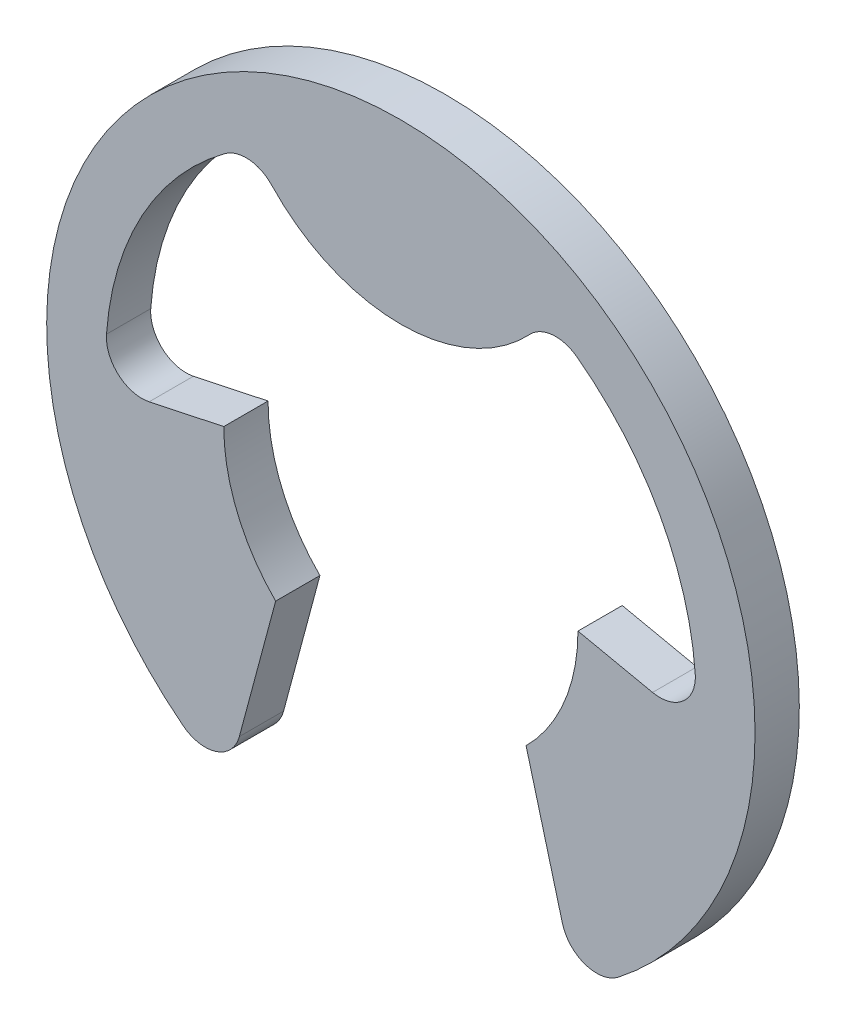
ISO-10303-21;
HEADER;
FILE_DESCRIPTION(('STEP AP214'),'2;1');
FILE_NAME('part.step','',(''),(''),'','','');
FILE_SCHEMA(('AUTOMOTIVE_DESIGN { 1 0 10303 214 1 1 1 1 }'));
ENDSEC;
DATA;
#1=APPLICATION_CONTEXT('core data for automotive mechanical design processes');
#2=APPLICATION_PROTOCOL_DEFINITION('international standard','automotive_design',2000,#1);
#3=PRODUCT_CONTEXT('',#1,'mechanical');
#4=PRODUCT('Part','Part','',(#3));
#5=PRODUCT_RELATED_PRODUCT_CATEGORY('part','',(#4));
#6=PRODUCT_DEFINITION_FORMATION('','',#4);
#7=PRODUCT_DEFINITION_CONTEXT('part definition',#1,'design');
#8=PRODUCT_DEFINITION('design','',#6,#7);
#9=PRODUCT_DEFINITION_SHAPE('','',#8);
#10=(LENGTH_UNIT() NAMED_UNIT(*) SI_UNIT(.MILLI.,.METRE.));
#11=(NAMED_UNIT(*) PLANE_ANGLE_UNIT() SI_UNIT($,.RADIAN.));
#12=(NAMED_UNIT(*) SI_UNIT($,.STERADIAN.) SOLID_ANGLE_UNIT());
#13=UNCERTAINTY_MEASURE_WITH_UNIT(LENGTH_MEASURE(1.E-05),#10,'distance_accuracy_value','');
#14=(GEOMETRIC_REPRESENTATION_CONTEXT(3) GLOBAL_UNCERTAINTY_ASSIGNED_CONTEXT((#13)) GLOBAL_UNIT_ASSIGNED_CONTEXT((#10,
#11,#12)) REPRESENTATION_CONTEXT('',''));
#15=CARTESIAN_POINT('',(0.,0.,0.));
#16=DIRECTION('',(0.,0.,1.));
#17=DIRECTION('',(1.,0.,0.));
#18=AXIS2_PLACEMENT_3D('',#15,#16,#17);
#19=CARTESIAN_POINT('',(0.,8.,-0.5));
#20=DIRECTION('',(0.,0.,1.));
#21=DIRECTION('',(1.,0.,0.));
#22=AXIS2_PLACEMENT_3D('',#19,#20,#21);
#23=PLANE('',#22);
#24=CARTESIAN_POINT('',(0.,0.,-0.5));
#25=DIRECTION('',(0.,0.,-1.));
#26=DIRECTION('',(-1.,0.,0.));
#27=AXIS2_PLACEMENT_3D('',#24,#25,#26);
#28=CIRCLE('',#27,6.666666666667);
#29=CARTESIAN_POINT('',(-3.97292130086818,5.35353535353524,-0.5));
#30=VERTEX_POINT('',#29);
#31=CARTESIAN_POINT('',(-6.64919627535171,0.482320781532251,-0.5));
#32=VERTEX_POINT('',#31);
#33=EDGE_CURVE('E204',#30,#32,#28,.F.);
#34=ORIENTED_EDGE('',*,*,#33,.T.);
#35=CARTESIAN_POINT('',(-5.851298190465,0.4243668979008,-0.5));
#36=DIRECTION('',(0.,0.,1.));
#37=DIRECTION('',(1.,0.,0.));
#38=AXIS2_PLACEMENT_3D('',#35,#36,#37);
#39=CIRCLE('',#38,0.8);
#40=CARTESIAN_POINT('',(-5.68496883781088,-0.358151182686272,-0.5));
#41=VERTEX_POINT('',#40);
#42=EDGE_CURVE('E206',#32,#41,#39,.T.);
#43=ORIENTED_EDGE('',*,*,#42,.T.);
#44=DIRECTION('',(0.978147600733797,0.207911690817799,0.));
#45=VECTOR('',#44,1.);
#46=CARTESIAN_POINT('',(-5.684968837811,-0.3581511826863,-0.5));
#47=LINE('',#46,#45);
#48=CARTESIAN_POINT('',(-4.,0.,-0.5));
#49=VERTEX_POINT('',#48);
#50=EDGE_CURVE('E153',#41,#49,#47,.T.);
#51=ORIENTED_EDGE('',*,*,#50,.T.);
#52=CARTESIAN_POINT('',(0.,0.,-0.5));
#53=DIRECTION('',(0.,0.,-1.));
#54=DIRECTION('',(-1.,0.,0.));
#55=AXIS2_PLACEMENT_3D('',#52,#53,#54);
#56=CIRCLE('',#55,4.);
#57=CARTESIAN_POINT('',(-2.82842712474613,-2.82842712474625,-0.5));
#58=VERTEX_POINT('',#57);
#59=EDGE_CURVE('E209',#49,#58,#56,.F.);
#60=ORIENTED_EDGE('',*,*,#59,.T.);
#61=DIRECTION('',(-0.258819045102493,-0.965925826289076,0.));
#62=VECTOR('',#61,1.);
#63=CARTESIAN_POINT('',(-2.828427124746,-2.828427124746,-0.5));
#64=LINE('',#63,#62);
#65=CARTESIAN_POINT('',(-3.64866297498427,-5.88958899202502,-0.5));
#66=VERTEX_POINT('',#65);
#67=EDGE_CURVE('E157',#58,#66,#64,.T.);
#68=ORIENTED_EDGE('',*,*,#67,.T.);
#69=CARTESIAN_POINT('',(-4.421403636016,-5.682533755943,-0.5));
#70=DIRECTION('',(0.,0.,-1.));
#71=DIRECTION('',(-1.,0.,0.));
#72=AXIS2_PLACEMENT_3D('',#69,#70,#71);
#73=CIRCLE('',#72,0.8);
#74=CARTESIAN_POINT('',(-4.91267070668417,-6.31392639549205,-0.5));
#75=VERTEX_POINT('',#74);
#76=EDGE_CURVE('E160',#75,#66,#73,.F.);
#77=ORIENTED_EDGE('',*,*,#76,.F.);
#78=CARTESIAN_POINT('',(0.,0.,-0.5));
#79=DIRECTION('',(0.,0.,-1.));
#80=DIRECTION('',(-1.,0.,0.));
#81=AXIS2_PLACEMENT_3D('',#78,#79,#80);
#82=CIRCLE('',#81,8.);
#83=CARTESIAN_POINT('',(4.91267070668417,-6.31392639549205,-0.5));
#84=VERTEX_POINT('',#83);
#85=EDGE_CURVE('E214',#84,#75,#82,.F.);
#86=ORIENTED_EDGE('',*,*,#85,.F.);
#87=CARTESIAN_POINT('',(4.421403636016,-5.682533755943,-0.5));
#88=DIRECTION('',(0.,0.,-1.));
#89=DIRECTION('',(-1.,0.,0.));
#90=AXIS2_PLACEMENT_3D('',#87,#88,#89);
#91=CIRCLE('',#90,0.8);
#92=CARTESIAN_POINT('',(3.64866297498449,-5.88958899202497,-0.5));
#93=VERTEX_POINT('',#92);
#94=EDGE_CURVE('E217',#93,#84,#91,.F.);
#95=ORIENTED_EDGE('',*,*,#94,.F.);
#96=DIRECTION('',(-0.258819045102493,0.965925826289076,0.));
#97=VECTOR('',#96,1.);
#98=CARTESIAN_POINT('',(2.828427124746,-2.828427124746,-0.5));
#99=LINE('',#98,#97);
#100=CARTESIAN_POINT('',(2.82842712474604,-2.82842712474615,-0.5));
#101=VERTEX_POINT('',#100);
#102=EDGE_CURVE('E161',#93,#101,#99,.T.);
#103=ORIENTED_EDGE('',*,*,#102,.T.);
#104=CARTESIAN_POINT('',(0.,0.,-0.5));
#105=DIRECTION('',(0.,0.,-1.));
#106=DIRECTION('',(-1.,0.,0.));
#107=AXIS2_PLACEMENT_3D('',#104,#105,#106);
#108=CIRCLE('',#107,4.);
#109=CARTESIAN_POINT('',(4.,0.,-0.5));
#110=VERTEX_POINT('',#109);
#111=EDGE_CURVE('E221',#101,#110,#108,.F.);
#112=ORIENTED_EDGE('',*,*,#111,.T.);
#113=DIRECTION('',(0.978147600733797,-0.207911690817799,0.));
#114=VECTOR('',#113,1.);
#115=CARTESIAN_POINT('',(5.684968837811,-0.3581511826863,-0.5));
#116=LINE('',#115,#114);
#117=CARTESIAN_POINT('',(5.68496883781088,-0.358151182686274,-0.5));
#118=VERTEX_POINT('',#117);
#119=EDGE_CURVE('E165',#110,#118,#116,.T.);
#120=ORIENTED_EDGE('',*,*,#119,.T.);
#121=CARTESIAN_POINT('',(5.851298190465,0.4243668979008,-0.5));
#122=DIRECTION('',(0.,0.,-1.));
#123=DIRECTION('',(-1.,0.,0.));
#124=AXIS2_PLACEMENT_3D('',#121,#122,#123);
#125=CIRCLE('',#124,0.8);
#126=CARTESIAN_POINT('',(6.64920248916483,0.482235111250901,-0.5));
#127=VERTEX_POINT('',#126);
#128=EDGE_CURVE('E133',#118,#127,#125,.F.);
#129=ORIENTED_EDGE('',*,*,#128,.T.);
#130=CARTESIAN_POINT('',(0.,0.,-0.5));
#131=DIRECTION('',(0.,0.,-1.));
#132=DIRECTION('',(-1.,0.,0.));
#133=AXIS2_PLACEMENT_3D('',#130,#131,#132);
#134=CIRCLE('',#133,6.666666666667);
#135=CARTESIAN_POINT('',(3.97292130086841,5.35353535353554,-0.5));
#136=VERTEX_POINT('',#135);
#137=EDGE_CURVE('E128',#127,#136,#134,.F.);
#138=ORIENTED_EDGE('',*,*,#137,.T.);
#139=CARTESIAN_POINT('',(3.496170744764,4.711111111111,-0.5));
#140=DIRECTION('',(0.,0.,-1.));
#141=DIRECTION('',(-1.,0.,0.));
#142=AXIS2_PLACEMENT_3D('',#139,#140,#141);
#143=CIRCLE('',#142,0.8);
#144=CARTESIAN_POINT('',(2.91347562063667,5.25925925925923,-0.5));
#145=VERTEX_POINT('',#144);
#146=EDGE_CURVE('E21',#136,#145,#143,.F.);
#147=ORIENTED_EDGE('',*,*,#146,.T.);
#148=CARTESIAN_POINT('',(0.,8.,-0.5));
#149=DIRECTION('',(0.,0.,-1.));
#150=DIRECTION('',(-1.,0.,0.));
#151=AXIS2_PLACEMENT_3D('',#148,#149,#150);
#152=CIRCLE('',#151,4.);
#153=CARTESIAN_POINT('',(-2.91347562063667,5.25925925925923,-0.5));
#154=VERTEX_POINT('',#153);
#155=EDGE_CURVE('E198',#154,#145,#152,.F.);
#156=ORIENTED_EDGE('',*,*,#155,.F.);
#157=CARTESIAN_POINT('',(-3.496170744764,4.711111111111,-0.5));
#158=DIRECTION('',(0.,0.,-1.));
#159=DIRECTION('',(-1.,0.,0.));
#160=AXIS2_PLACEMENT_3D('',#157,#158,#159);
#161=CIRCLE('',#160,0.8);
#162=EDGE_CURVE('E200',#154,#30,#161,.F.);
#163=ORIENTED_EDGE('',*,*,#162,.T.);
#164=EDGE_LOOP('',(#34,#43,#51,#60,#68,#77,#86,#95,#103,#112,#120,#129,#138,#147,#156,#163));
#165=FACE_BOUND('',#164,.T.);
#166=ADVANCED_FACE('F17',(#165),#23,.F.);
#167=CARTESIAN_POINT('',(3.496170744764,4.711111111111,0.5));
#168=DIRECTION('',(0.,0.,-1.));
#169=DIRECTION('',(-1.,0.,0.));
#170=AXIS2_PLACEMENT_3D('',#167,#168,#169);
#171=CYLINDRICAL_SURFACE('',#170,0.8);
#172=CARTESIAN_POINT('',(3.496170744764,4.711111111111,0.5));
#173=DIRECTION('',(0.,0.,-1.));
#174=DIRECTION('',(-1.,0.,0.));
#175=AXIS2_PLACEMENT_3D('',#172,#173,#174);
#176=CIRCLE('',#175,0.8);
#177=CARTESIAN_POINT('',(2.91347562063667,5.25925925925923,0.5));
#178=VERTEX_POINT('',#177);
#179=CARTESIAN_POINT('',(3.97292130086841,5.35353535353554,0.5));
#180=VERTEX_POINT('',#179);
#181=EDGE_CURVE('E196',#178,#180,#176,.T.);
#182=ORIENTED_EDGE('',*,*,#181,.F.);
#183=DIRECTION('',(0.,0.,-1.));
#184=VECTOR('',#183,1.);
#185=CARTESIAN_POINT('',(2.91347562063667,5.25925925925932,0.5));
#186=LINE('',#185,#184);
#187=EDGE_CURVE('E142',#145,#178,#186,.F.);
#188=ORIENTED_EDGE('',*,*,#187,.F.);
#189=ORIENTED_EDGE('',*,*,#146,.F.);
#190=DIRECTION('',(0.,0.,-1.));
#191=VECTOR('',#190,1.);
#192=CARTESIAN_POINT('',(3.97292130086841,5.35353535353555,0.5));
#193=LINE('',#192,#191);
#194=EDGE_CURVE('E137',#136,#180,#193,.F.);
#195=ORIENTED_EDGE('',*,*,#194,.T.);
#196=EDGE_LOOP('',(#182,#188,#189,#195));
#197=FACE_BOUND('',#196,.T.);
#198=ADVANCED_FACE('F139',(#197),#171,.F.);
#199=CARTESIAN_POINT('',(0.,0.,0.5));
#200=DIRECTION('',(0.,0.,-1.));
#201=DIRECTION('',(-1.,0.,0.));
#202=AXIS2_PLACEMENT_3D('',#199,#200,#201);
#203=CYLINDRICAL_SURFACE('',#202,6.666666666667);
#204=CARTESIAN_POINT('',(0.,0.,0.5));
#205=DIRECTION('',(0.,0.,-1.));
#206=DIRECTION('',(-1.,0.,0.));
#207=AXIS2_PLACEMENT_3D('',#204,#205,#206);
#208=CIRCLE('',#207,6.666666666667);
#209=CARTESIAN_POINT('',(6.64920248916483,0.482235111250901,0.5));
#210=VERTEX_POINT('',#209);
#211=EDGE_CURVE('E146',#180,#210,#208,.T.);
#212=ORIENTED_EDGE('',*,*,#211,.F.);
#213=ORIENTED_EDGE('',*,*,#194,.F.);
#214=ORIENTED_EDGE('',*,*,#137,.F.);
#215=DIRECTION('',(0.,0.,-1.));
#216=VECTOR('',#215,1.);
#217=CARTESIAN_POINT('',(6.64920248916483,0.482235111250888,0.5));
#218=LINE('',#217,#216);
#219=EDGE_CURVE('E148',#127,#210,#218,.F.);
#220=ORIENTED_EDGE('',*,*,#219,.T.);
#221=EDGE_LOOP('',(#212,#213,#214,#220));
#222=FACE_BOUND('',#221,.T.);
#223=ADVANCED_FACE('F144',(#222),#203,.F.);
#224=CARTESIAN_POINT('',(5.851298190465,0.4243668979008,0.5));
#225=DIRECTION('',(0.,0.,-1.));
#226=DIRECTION('',(-1.,0.,0.));
#227=AXIS2_PLACEMENT_3D('',#224,#225,#226);
#228=CYLINDRICAL_SURFACE('',#227,0.8);
#229=DIRECTION('',(0.,0.,1.));
#230=VECTOR('',#229,1.);
#231=CARTESIAN_POINT('',(5.684968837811,-0.3581511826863,0.5));
#232=LINE('',#231,#230);
#233=CARTESIAN_POINT('',(5.68496883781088,-0.358151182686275,0.5));
#234=VERTEX_POINT('',#233);
#235=EDGE_CURVE('E166',#118,#234,#232,.T.);
#236=ORIENTED_EDGE('',*,*,#235,.T.);
#237=CARTESIAN_POINT('',(5.851298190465,0.4243668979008,0.5));
#238=DIRECTION('',(0.,0.,1.));
#239=DIRECTION('',(1.,0.,0.));
#240=AXIS2_PLACEMENT_3D('',#237,#238,#239);
#241=CIRCLE('',#240,0.8);
#242=EDGE_CURVE('E193',#210,#234,#241,.F.);
#243=ORIENTED_EDGE('',*,*,#242,.F.);
#244=ORIENTED_EDGE('',*,*,#219,.F.);
#245=ORIENTED_EDGE('',*,*,#128,.F.);
#246=EDGE_LOOP('',(#236,#243,#244,#245));
#247=FACE_BOUND('',#246,.T.);
#248=ADVANCED_FACE('F321',(#247),#228,.F.);
#249=CARTESIAN_POINT('',(5.684968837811,-0.3581511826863,0.5));
#250=DIRECTION('',(-0.207911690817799,-0.978147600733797,0.));
#251=DIRECTION('',(0.978147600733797,-0.207911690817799,0.));
#252=AXIS2_PLACEMENT_3D('',#249,#250,#251);
#253=PLANE('',#252);
#254=DIRECTION('',(-0.978147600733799,0.207911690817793,0.));
#255=VECTOR('',#254,1.);
#256=CARTESIAN_POINT('',(5.684968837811,-0.358151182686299,0.5));
#257=LINE('',#256,#255);
#258=CARTESIAN_POINT('',(4.,0.,0.5));
#259=VERTEX_POINT('',#258);
#260=EDGE_CURVE('E192',#234,#259,#257,.T.);
#261=ORIENTED_EDGE('',*,*,#260,.F.);
#262=ORIENTED_EDGE('',*,*,#235,.F.);
#263=ORIENTED_EDGE('',*,*,#119,.F.);
#264=DIRECTION('',(0.,0.,-1.));
#265=VECTOR('',#264,1.);
#266=CARTESIAN_POINT('',(4.,0.,0.5));
#267=LINE('',#266,#265);
#268=EDGE_CURVE('E164',#110,#259,#267,.F.);
#269=ORIENTED_EDGE('',*,*,#268,.T.);
#270=EDGE_LOOP('',(#261,#262,#263,#269));
#271=FACE_BOUND('',#270,.T.);
#272=ADVANCED_FACE('F317',(#271),#253,.F.);
#273=CARTESIAN_POINT('',(0.,0.,0.5));
#274=DIRECTION('',(0.,0.,-1.));
#275=DIRECTION('',(-1.,0.,0.));
#276=AXIS2_PLACEMENT_3D('',#273,#274,#275);
#277=CYLINDRICAL_SURFACE('',#276,4.);
#278=CARTESIAN_POINT('',(0.,0.,0.5));
#279=DIRECTION('',(0.,0.,-1.));
#280=DIRECTION('',(-1.,0.,0.));
#281=AXIS2_PLACEMENT_3D('',#278,#279,#280);
#282=CIRCLE('',#281,4.);
#283=CARTESIAN_POINT('',(2.82842712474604,-2.82842712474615,0.5));
#284=VERTEX_POINT('',#283);
#285=EDGE_CURVE('E189',#259,#284,#282,.T.);
#286=ORIENTED_EDGE('',*,*,#285,.F.);
#287=ORIENTED_EDGE('',*,*,#268,.F.);
#288=ORIENTED_EDGE('',*,*,#111,.F.);
#289=DIRECTION('',(0.,0.,1.));
#290=VECTOR('',#289,1.);
#291=CARTESIAN_POINT('',(2.828427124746,-2.828427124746,0.5));
#292=LINE('',#291,#290);
#293=EDGE_CURVE('E163',#101,#284,#292,.T.);
#294=ORIENTED_EDGE('',*,*,#293,.T.);
#295=EDGE_LOOP('',(#286,#287,#288,#294));
#296=FACE_BOUND('',#295,.T.);
#297=ADVANCED_FACE('F313',(#296),#277,.F.);
#298=CARTESIAN_POINT('',(2.828427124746,-2.828427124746,0.5));
#299=DIRECTION('',(0.965925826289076,0.258819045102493,0.));
#300=DIRECTION('',(-0.258819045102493,0.965925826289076,0.));
#301=AXIS2_PLACEMENT_3D('',#298,#299,#300);
#302=PLANE('',#301);
#303=DIRECTION('',(0.258819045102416,-0.965925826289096,0.));
#304=VECTOR('',#303,1.);
#305=CARTESIAN_POINT('',(2.828427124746,-2.828427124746,0.5));
#306=LINE('',#305,#304);
#307=CARTESIAN_POINT('',(3.64866297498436,-5.88958899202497,0.5));
#308=VERTEX_POINT('',#307);
#309=EDGE_CURVE('E188',#284,#308,#306,.T.);
#310=ORIENTED_EDGE('',*,*,#309,.F.);
#311=ORIENTED_EDGE('',*,*,#293,.F.);
#312=ORIENTED_EDGE('',*,*,#102,.F.);
#313=DIRECTION('',(0.,0.,-1.));
#314=VECTOR('',#313,1.);
#315=CARTESIAN_POINT('',(3.64866297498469,-5.88958899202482,0.5));
#316=LINE('',#315,#314);
#317=EDGE_CURVE('E220',#308,#93,#316,.T.);
#318=ORIENTED_EDGE('',*,*,#317,.F.);
#319=EDGE_LOOP('',(#310,#311,#312,#318));
#320=FACE_BOUND('',#319,.T.);
#321=ADVANCED_FACE('F309',(#320),#302,.F.);
#322=CARTESIAN_POINT('',(4.421403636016,-5.682533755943,0.5));
#323=DIRECTION('',(0.,0.,-1.));
#324=DIRECTION('',(-1.,0.,0.));
#325=AXIS2_PLACEMENT_3D('',#322,#323,#324);
#326=CYLINDRICAL_SURFACE('',#325,0.8);
#327=ORIENTED_EDGE('',*,*,#317,.T.);
#328=ORIENTED_EDGE('',*,*,#94,.T.);
#329=DIRECTION('',(0.,0.,-1.));
#330=VECTOR('',#329,1.);
#331=CARTESIAN_POINT('',(4.91267070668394,-6.31392639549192,0.5));
#332=LINE('',#331,#330);
#333=CARTESIAN_POINT('',(4.91267070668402,-6.31392639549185,0.5));
#334=VERTEX_POINT('',#333);
#335=EDGE_CURVE('E216',#334,#84,#332,.T.);
#336=ORIENTED_EDGE('',*,*,#335,.F.);
#337=CARTESIAN_POINT('',(4.421403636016,-5.682533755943,0.5));
#338=DIRECTION('',(0.,0.,-1.));
#339=DIRECTION('',(-1.,0.,0.));
#340=AXIS2_PLACEMENT_3D('',#337,#338,#339);
#341=CIRCLE('',#340,0.8);
#342=EDGE_CURVE('E185',#308,#334,#341,.F.);
#343=ORIENTED_EDGE('',*,*,#342,.F.);
#344=EDGE_LOOP('',(#327,#328,#336,#343));
#345=FACE_BOUND('',#344,.T.);
#346=ADVANCED_FACE('F305',(#345),#326,.T.);
#347=CARTESIAN_POINT('',(0.,0.,0.5));
#348=DIRECTION('',(0.,0.,-1.));
#349=DIRECTION('',(-1.,0.,0.));
#350=AXIS2_PLACEMENT_3D('',#347,#348,#349);
#351=CYLINDRICAL_SURFACE('',#350,8.);
#352=DIRECTION('',(0.,0.,-1.));
#353=VECTOR('',#352,1.);
#354=CARTESIAN_POINT('',(-4.91267070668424,-6.31392639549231,0.5));
#355=LINE('',#354,#353);
#356=CARTESIAN_POINT('',(-4.91267070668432,-6.31392639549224,0.5));
#357=VERTEX_POINT('',#356);
#358=EDGE_CURVE('E213',#357,#75,#355,.T.);
#359=ORIENTED_EDGE('',*,*,#358,.F.);
#360=CARTESIAN_POINT('',(0.,0.,0.5));
#361=DIRECTION('',(0.,0.,-1.));
#362=DIRECTION('',(-1.,0.,0.));
#363=AXIS2_PLACEMENT_3D('',#360,#361,#362);
#364=CIRCLE('',#363,8.);
#365=EDGE_CURVE('E183',#334,#357,#364,.F.);
#366=ORIENTED_EDGE('',*,*,#365,.F.);
#367=ORIENTED_EDGE('',*,*,#335,.T.);
#368=ORIENTED_EDGE('',*,*,#85,.T.);
#369=EDGE_LOOP('',(#359,#366,#367,#368));
#370=FACE_BOUND('',#369,.T.);
#371=ADVANCED_FACE('F301',(#370),#351,.T.);
#372=CARTESIAN_POINT('',(-4.421403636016,-5.682533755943,0.5));
#373=DIRECTION('',(0.,0.,-1.));
#374=DIRECTION('',(-1.,0.,0.));
#375=AXIS2_PLACEMENT_3D('',#372,#373,#374);
#376=CYLINDRICAL_SURFACE('',#375,0.8);
#377=ORIENTED_EDGE('',*,*,#358,.T.);
#378=ORIENTED_EDGE('',*,*,#76,.T.);
#379=DIRECTION('',(0.,0.,1.));
#380=VECTOR('',#379,1.);
#381=CARTESIAN_POINT('',(-3.64866297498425,-5.88958899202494,0.5));
#382=LINE('',#381,#380);
#383=CARTESIAN_POINT('',(-3.64866297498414,-5.88958899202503,0.5));
#384=VERTEX_POINT('',#383);
#385=EDGE_CURVE('E159',#66,#384,#382,.T.);
#386=ORIENTED_EDGE('',*,*,#385,.T.);
#387=CARTESIAN_POINT('',(-4.421403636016,-5.682533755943,0.5));
#388=DIRECTION('',(0.,0.,-1.));
#389=DIRECTION('',(-1.,0.,0.));
#390=AXIS2_PLACEMENT_3D('',#387,#388,#389);
#391=CIRCLE('',#390,0.8);
#392=EDGE_CURVE('E180',#357,#384,#391,.F.);
#393=ORIENTED_EDGE('',*,*,#392,.F.);
#394=EDGE_LOOP('',(#377,#378,#386,#393));
#395=FACE_BOUND('',#394,.T.);
#396=ADVANCED_FACE('F297',(#395),#376,.T.);
#397=CARTESIAN_POINT('',(-2.828427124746,-2.828427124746,0.5));
#398=DIRECTION('',(-0.965925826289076,0.258819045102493,0.));
#399=DIRECTION('',(-0.258819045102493,-0.965925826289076,0.));
#400=AXIS2_PLACEMENT_3D('',#397,#398,#399);
#401=PLANE('',#400);
#402=DIRECTION('',(0.258819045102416,0.965925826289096,0.));
#403=VECTOR('',#402,1.);
#404=CARTESIAN_POINT('',(-3.648662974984,-5.889588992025,0.5));
#405=LINE('',#404,#403);
#406=CARTESIAN_POINT('',(-2.82842712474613,-2.82842712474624,0.5));
#407=VERTEX_POINT('',#406);
#408=EDGE_CURVE('E179',#384,#407,#405,.T.);
#409=ORIENTED_EDGE('',*,*,#408,.F.);
#410=ORIENTED_EDGE('',*,*,#385,.F.);
#411=ORIENTED_EDGE('',*,*,#67,.F.);
#412=DIRECTION('',(0.,0.,-1.));
#413=VECTOR('',#412,1.);
#414=CARTESIAN_POINT('',(-2.82842712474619,-2.82842712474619,0.5));
#415=LINE('',#414,#413);
#416=EDGE_CURVE('E156',#58,#407,#415,.F.);
#417=ORIENTED_EDGE('',*,*,#416,.T.);
#418=EDGE_LOOP('',(#409,#410,#411,#417));
#419=FACE_BOUND('',#418,.T.);
#420=ADVANCED_FACE('F293',(#419),#401,.F.);
#421=CARTESIAN_POINT('',(0.,0.,0.5));
#422=DIRECTION('',(0.,0.,-1.));
#423=DIRECTION('',(-1.,0.,0.));
#424=AXIS2_PLACEMENT_3D('',#421,#422,#423);
#425=CYLINDRICAL_SURFACE('',#424,4.);
#426=CARTESIAN_POINT('',(0.,0.,0.5));
#427=DIRECTION('',(0.,0.,-1.));
#428=DIRECTION('',(-1.,0.,0.));
#429=AXIS2_PLACEMENT_3D('',#426,#427,#428);
#430=CIRCLE('',#429,4.);
#431=CARTESIAN_POINT('',(-4.,0.,0.5));
#432=VERTEX_POINT('',#431);
#433=EDGE_CURVE('E176',#407,#432,#430,.T.);
#434=ORIENTED_EDGE('',*,*,#433,.F.);
#435=ORIENTED_EDGE('',*,*,#416,.F.);
#436=ORIENTED_EDGE('',*,*,#59,.F.);
#437=DIRECTION('',(0.,0.,1.));
#438=VECTOR('',#437,1.);
#439=CARTESIAN_POINT('',(-4.,0.,0.5));
#440=LINE('',#439,#438);
#441=EDGE_CURVE('E155',#49,#432,#440,.T.);
#442=ORIENTED_EDGE('',*,*,#441,.T.);
#443=EDGE_LOOP('',(#434,#435,#436,#442));
#444=FACE_BOUND('',#443,.T.);
#445=ADVANCED_FACE('F290',(#444),#425,.F.);
#446=CARTESIAN_POINT('',(-5.684968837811,-0.3581511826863,0.5));
#447=DIRECTION('',(0.207911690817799,-0.978147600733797,0.));
#448=DIRECTION('',(0.978147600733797,0.207911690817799,0.));
#449=AXIS2_PLACEMENT_3D('',#446,#447,#448);
#450=PLANE('',#449);
#451=DIRECTION('',(-0.978147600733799,-0.207911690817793,0.));
#452=VECTOR('',#451,1.);
#453=CARTESIAN_POINT('',(-4.,0.,0.5));
#454=LINE('',#453,#452);
#455=CARTESIAN_POINT('',(-5.68496883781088,-0.358151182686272,0.5));
#456=VERTEX_POINT('',#455);
#457=EDGE_CURVE('E175',#432,#456,#454,.T.);
#458=ORIENTED_EDGE('',*,*,#457,.F.);
#459=ORIENTED_EDGE('',*,*,#441,.F.);
#460=ORIENTED_EDGE('',*,*,#50,.F.);
#461=DIRECTION('',(0.,0.,-1.));
#462=VECTOR('',#461,1.);
#463=CARTESIAN_POINT('',(-5.684968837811,-0.358151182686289,0.5));
#464=LINE('',#463,#462);
#465=EDGE_CURVE('E208',#41,#456,#464,.F.);
#466=ORIENTED_EDGE('',*,*,#465,.T.);
#467=EDGE_LOOP('',(#458,#459,#460,#466));
#468=FACE_BOUND('',#467,.T.);
#469=ADVANCED_FACE('F261',(#468),#450,.F.);
#470=CARTESIAN_POINT('',(-5.851298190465,0.4243668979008,0.5));
#471=DIRECTION('',(0.,0.,-1.));
#472=DIRECTION('',(-1.,0.,0.));
#473=AXIS2_PLACEMENT_3D('',#470,#471,#472);
#474=CYLINDRICAL_SURFACE('',#473,0.8);
#475=ORIENTED_EDGE('',*,*,#42,.F.);
#476=DIRECTION('',(0.,0.,-1.));
#477=VECTOR('',#476,1.);
#478=CARTESIAN_POINT('',(-6.64919627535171,0.482320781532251,0.5));
#479=LINE('',#478,#477);
#480=CARTESIAN_POINT('',(-6.64919627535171,0.482320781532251,0.5));
#481=VERTEX_POINT('',#480);
#482=EDGE_CURVE('E203',#32,#481,#479,.F.);
#483=ORIENTED_EDGE('',*,*,#482,.T.);
#484=CARTESIAN_POINT('',(-5.851298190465,0.4243668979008,0.5));
#485=DIRECTION('',(0.,0.,-1.));
#486=DIRECTION('',(-1.,0.,0.));
#487=AXIS2_PLACEMENT_3D('',#484,#485,#486);
#488=CIRCLE('',#487,0.8);
#489=EDGE_CURVE('E173',#456,#481,#488,.T.);
#490=ORIENTED_EDGE('',*,*,#489,.F.);
#491=ORIENTED_EDGE('',*,*,#465,.F.);
#492=EDGE_LOOP('',(#475,#483,#490,#491));
#493=FACE_BOUND('',#492,.T.);
#494=ADVANCED_FACE('F266',(#493),#474,.F.);
#495=CARTESIAN_POINT('',(0.,0.,0.5));
#496=DIRECTION('',(0.,0.,-1.));
#497=DIRECTION('',(-1.,0.,0.));
#498=AXIS2_PLACEMENT_3D('',#495,#496,#497);
#499=CYLINDRICAL_SURFACE('',#498,6.666666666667);
#500=CARTESIAN_POINT('',(0.,0.,0.5));
#501=DIRECTION('',(0.,0.,-1.));
#502=DIRECTION('',(-1.,0.,0.));
#503=AXIS2_PLACEMENT_3D('',#500,#501,#502);
#504=CIRCLE('',#503,6.666666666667);
#505=CARTESIAN_POINT('',(-3.97292130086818,5.35353535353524,0.5));
#506=VERTEX_POINT('',#505);
#507=EDGE_CURVE('E170',#481,#506,#504,.T.);
#508=ORIENTED_EDGE('',*,*,#507,.F.);
#509=ORIENTED_EDGE('',*,*,#482,.F.);
#510=ORIENTED_EDGE('',*,*,#33,.F.);
#511=DIRECTION('',(0.,0.,-1.));
#512=VECTOR('',#511,1.);
#513=CARTESIAN_POINT('',(-3.97292130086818,5.35353535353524,0.5));
#514=LINE('',#513,#512);
#515=EDGE_CURVE('E202',#30,#506,#514,.F.);
#516=ORIENTED_EDGE('',*,*,#515,.T.);
#517=EDGE_LOOP('',(#508,#509,#510,#516));
#518=FACE_BOUND('',#517,.T.);
#519=ADVANCED_FACE('F271',(#518),#499,.F.);
#520=CARTESIAN_POINT('',(-3.496170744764,4.711111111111,0.5));
#521=DIRECTION('',(0.,0.,-1.));
#522=DIRECTION('',(-1.,0.,0.));
#523=AXIS2_PLACEMENT_3D('',#520,#521,#522);
#524=CYLINDRICAL_SURFACE('',#523,0.8);
#525=CARTESIAN_POINT('',(-3.496170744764,4.711111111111,0.5));
#526=DIRECTION('',(0.,0.,-1.));
#527=DIRECTION('',(-1.,0.,0.));
#528=AXIS2_PLACEMENT_3D('',#525,#526,#527);
#529=CIRCLE('',#528,0.8);
#530=CARTESIAN_POINT('',(-2.91347562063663,5.25925925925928,0.5));
#531=VERTEX_POINT('',#530);
#532=EDGE_CURVE('E27',#506,#531,#529,.T.);
#533=ORIENTED_EDGE('',*,*,#532,.F.);
#534=ORIENTED_EDGE('',*,*,#515,.F.);
#535=ORIENTED_EDGE('',*,*,#162,.F.);
#536=DIRECTION('',(0.,0.,-1.));
#537=VECTOR('',#536,1.);
#538=CARTESIAN_POINT('',(-2.91347562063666,5.25925925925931,0.5));
#539=LINE('',#538,#537);
#540=EDGE_CURVE('E36',#531,#154,#539,.T.);
#541=ORIENTED_EDGE('',*,*,#540,.F.);
#542=EDGE_LOOP('',(#533,#534,#535,#541));
#543=FACE_BOUND('',#542,.T.);
#544=ADVANCED_FACE('F273',(#543),#524,.F.);
#545=CARTESIAN_POINT('',(0.,8.,0.5));
#546=DIRECTION('',(0.,0.,-1.));
#547=DIRECTION('',(-1.,0.,0.));
#548=AXIS2_PLACEMENT_3D('',#545,#546,#547);
#549=CYLINDRICAL_SURFACE('',#548,4.);
#550=ORIENTED_EDGE('',*,*,#540,.T.);
#551=ORIENTED_EDGE('',*,*,#155,.T.);
#552=ORIENTED_EDGE('',*,*,#187,.T.);
#553=CARTESIAN_POINT('',(0.,8.,0.5));
#554=DIRECTION('',(0.,0.,-1.));
#555=DIRECTION('',(-1.,0.,0.));
#556=AXIS2_PLACEMENT_3D('',#553,#554,#555);
#557=CIRCLE('',#556,4.);
#558=EDGE_CURVE('E11',#531,#178,#557,.F.);
#559=ORIENTED_EDGE('',*,*,#558,.F.);
#560=EDGE_LOOP('',(#550,#551,#552,#559));
#561=FACE_BOUND('',#560,.T.);
#562=ADVANCED_FACE('F275',(#561),#549,.T.);
#563=CARTESIAN_POINT('',(0.,8.,0.5));
#564=DIRECTION('',(0.,0.,1.));
#565=DIRECTION('',(1.,0.,0.));
#566=AXIS2_PLACEMENT_3D('',#563,#564,#565);
#567=PLANE('',#566);
#568=ORIENTED_EDGE('',*,*,#532,.T.);
#569=ORIENTED_EDGE('',*,*,#558,.T.);
#570=ORIENTED_EDGE('',*,*,#181,.T.);
#571=ORIENTED_EDGE('',*,*,#211,.T.);
#572=ORIENTED_EDGE('',*,*,#242,.T.);
#573=ORIENTED_EDGE('',*,*,#260,.T.);
#574=ORIENTED_EDGE('',*,*,#285,.T.);
#575=ORIENTED_EDGE('',*,*,#309,.T.);
#576=ORIENTED_EDGE('',*,*,#342,.T.);
#577=ORIENTED_EDGE('',*,*,#365,.T.);
#578=ORIENTED_EDGE('',*,*,#392,.T.);
#579=ORIENTED_EDGE('',*,*,#408,.T.);
#580=ORIENTED_EDGE('',*,*,#433,.T.);
#581=ORIENTED_EDGE('',*,*,#457,.T.);
#582=ORIENTED_EDGE('',*,*,#489,.T.);
#583=ORIENTED_EDGE('',*,*,#507,.T.);
#584=EDGE_LOOP('',(#568,#569,#570,#571,#572,#573,#574,#575,#576,#577,#578,#579,#580,#581,#582,#583));
#585=FACE_BOUND('',#584,.T.);
#586=ADVANCED_FACE('F19',(#585),#567,.T.);
#587=CLOSED_SHELL('',(#166,#198,#223,#248,#272,#297,#321,#346,#371,#396,#420,#445,#469,#494,
#519,#544,#562,#586));
#588=MANIFOLD_SOLID_BREP('B1',#587);
#589=ADVANCED_BREP_SHAPE_REPRESENTATION('',(#18,#588),#14);
#590=SHAPE_DEFINITION_REPRESENTATION(#9,#589);
ENDSEC;
END-ISO-10303-21;
